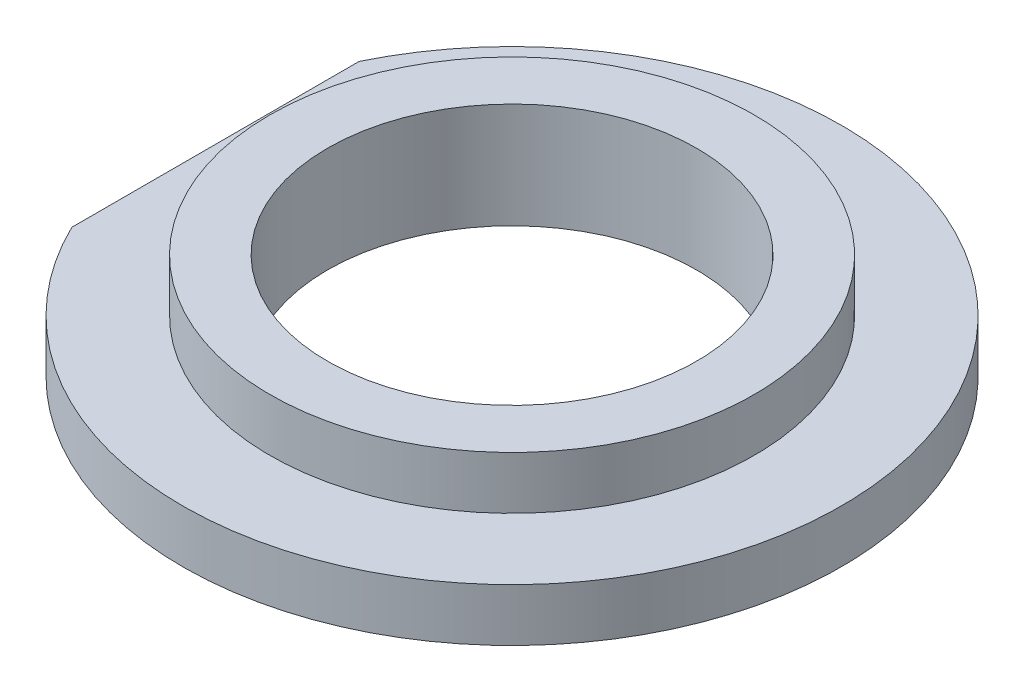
from build123d import *

# Parameters (mm, degrees)
SKETCH_2_R          = 56
CUT_EXTRUDE_1_DEPTH = 145.996551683
SKETCH_3_W          = 35.521209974
SKETCH_3_H          = 185.873917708
CUT_EXTRUDE_2_DEPTH = 143.323574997


with BuildPart() as part:
    # Sketch 1 → Revolve 1 (revolve)
    with BuildSketch(Plane.XY):
        Polygon((0, 0), (-100, 0), (-100, 16), (-73.5, 16), (-73.5, 32), (0, 32), align=None)
    revolve(axis=Axis((0, 32, 0), (0, -1, 0)))

    # Sketch 2 → Cut-Extrude 1 (cut, through all)
    with BuildSketch(Plane(origin=(0, 32, 0), x_dir=(1, 0, 0), z_dir=(0, 1, 0))):
        with Locations(Location((0, 0, 0), (0, 0, 180))):
            Circle(SKETCH_2_R)
    extrude(amount=-CUT_EXTRUDE_1_DEPTH, mode=Mode.SUBTRACT)

    # Sketch 3 → Cut-Extrude 2 (cut, through all)
    with BuildSketch(Plane(origin=(0, 16, 0), x_dir=(1, 0, 0), z_dir=(0, 1, 0))):
        with Locations((-107.760604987, -6.736781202)):
            Rectangle(SKETCH_3_W, SKETCH_3_H)
    extrude(amount=-CUT_EXTRUDE_2_DEPTH, mode=Mode.SUBTRACT)


solid = part.part
